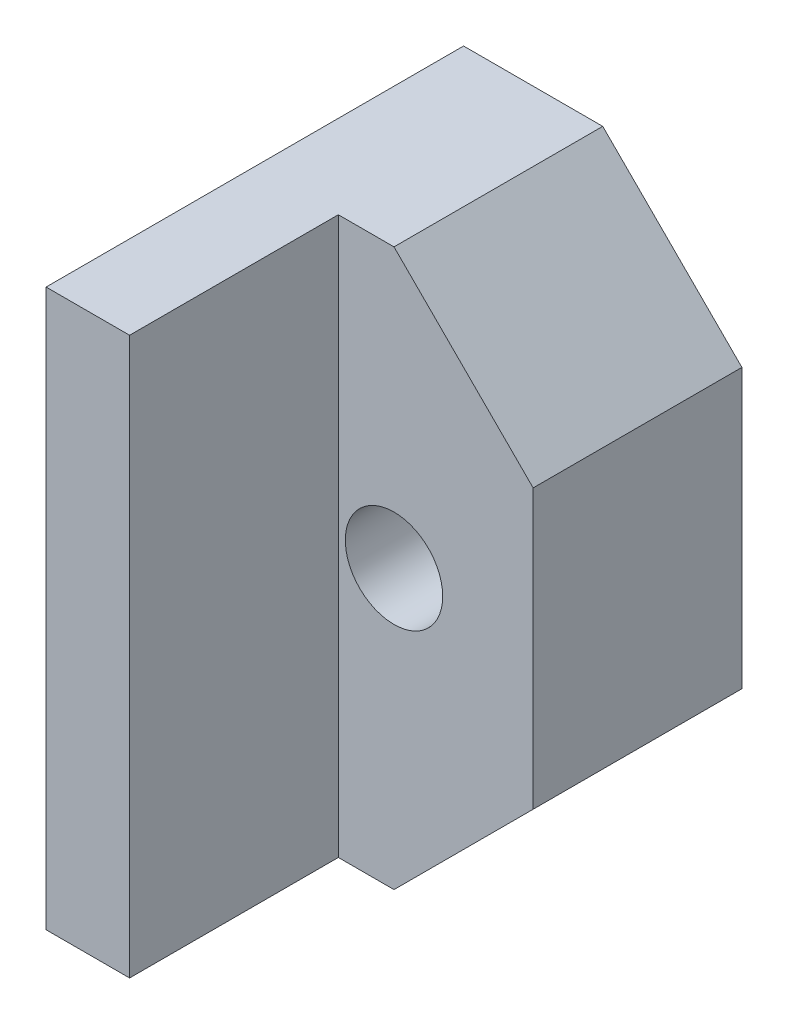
from build123d import *

# Parameters (mm, degrees)
SKETCH1_R           = 0.7
BOSS_EXTRUDE1_DEPTH = 6
CUT_EXTRUDE3_START  = -3
SKETCH2_R           = 0.7
CUT_EXTRUDE3_DEPTH  = 3


with BuildPart() as part:
    # Sketch1 → Boss-Extrude1 (new body)
    with BuildSketch(Plane.XY):
        Polygon((0, -4), (0, 4), (2, 4), (4, 2), (4, -2), (2, -4), align=None)
        with Locations((2, 0)):
            Circle(SKETCH1_R, mode=Mode.SUBTRACT)
    extrude(amount=BOSS_EXTRUDE1_DEPTH)

    # Sketch2 → Cut-Extrude3 (cut)
    with BuildSketch(Plane.XY.offset(6).offset(CUT_EXTRUDE3_START)):
        Polygon((2, 4), (1.2, 4), (1.2, -4), (2, -4), (4, -2), (4, 2), align=None)
        with Locations((2, 0)):
            Circle(SKETCH2_R, mode=Mode.SUBTRACT)
    extrude(amount=CUT_EXTRUDE3_DEPTH, mode=Mode.SUBTRACT)


solid = part.part
